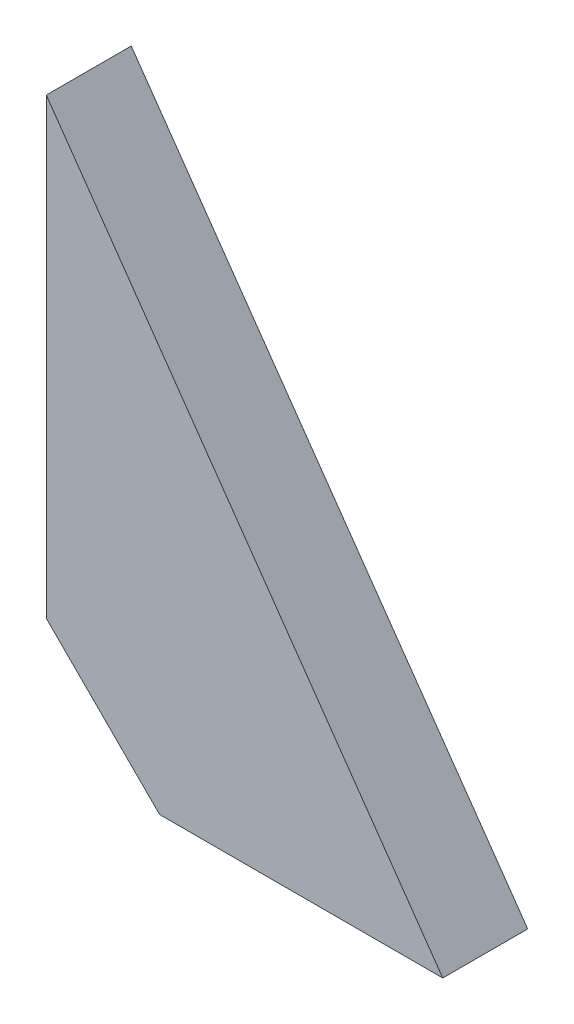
from build123d import *

# Parameters (mm, degrees)
BOSS_EXTRUDE1_DEPTH = 3


with BuildPart() as part:
    # Sketch1 → Boss-Extrude1 (new body)
    with BuildSketch(Plane.XY):
        Polygon((0, 20), (0, 4), (4, 0), (14, 0), align=None)
    extrude(amount=BOSS_EXTRUDE1_DEPTH)


solid = part.part
